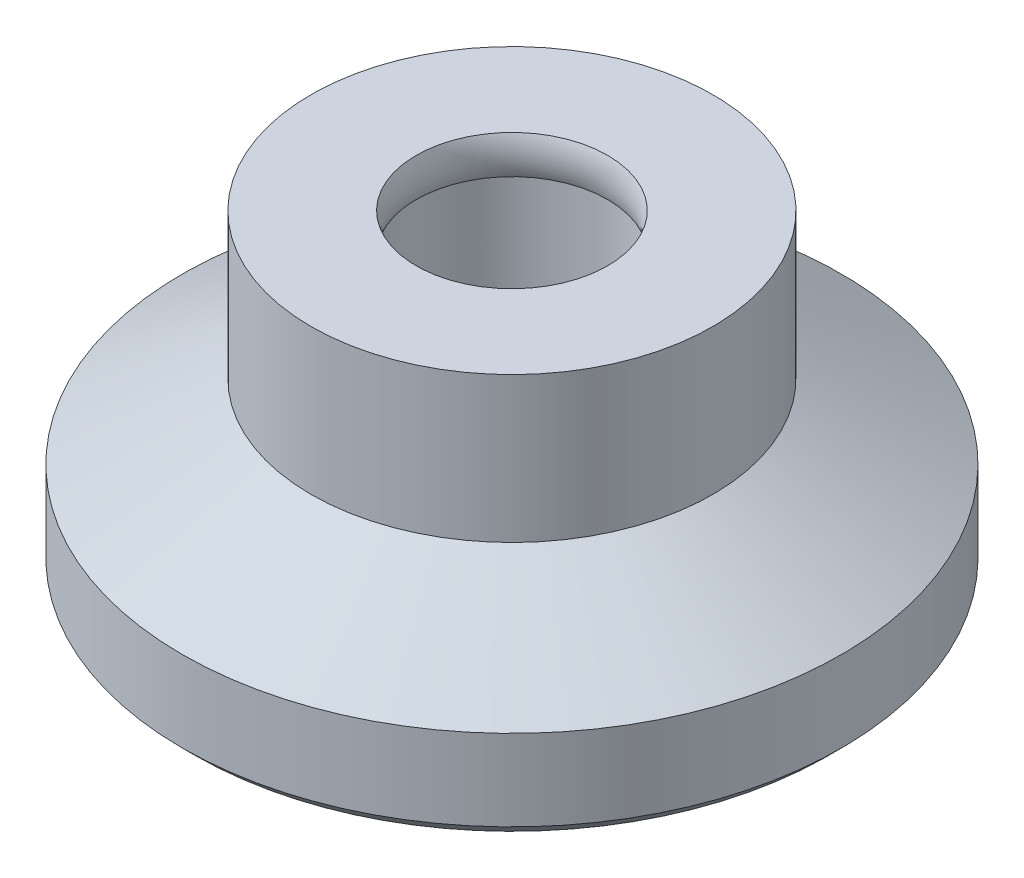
from build123d import *

# Parameters (mm, degrees)
SKETCH1_R      = 6.4
EXTRUDE1_DEPTH = 5
SKETCH3_R      = 10.5
EXTRUDE2_DEPTH = 3
CHAMFER1_SIZE  = 0.42


with BuildPart() as part:
    # Sketch1 → Extrude1 (new, symmetric)
    with BuildSketch(Plane(origin=(0, 0, 0), x_dir=(1, 0, 0), z_dir=(0, 1, 0))):
        with Locations(Location((0, 0, 0), (0, 0, 270))):
            Circle(SKETCH1_R)
    extrude(amount=EXTRUDE1_DEPTH, both=True)

    # Sketch3 → Extrude2 (add)
    with BuildSketch(Plane.XZ.offset(5)):
        with Locations(Location((0, 0, 0), (0, 0, 270))):
            Circle(SKETCH3_R)
    extrude(amount=-EXTRUDE2_DEPTH)

    # Sketch4 → Revolve1 (revolve)
    with BuildSketch(Plane.XY, mode=Mode.PRIVATE) as revolve1_sk:
        Polygon((-10.5, -2), (-6.4, 0.367136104), (-6.4, -2), align=None)
    revolve(revolve1_sk.sketch.rotate(Axis((0, 5, 0), (0, -1, 0)), 270), axis=Axis((0, 5, 0), (0, -1, 0)))

    # Chamfer1
    chamfer1_edges = [part.edges().sort_by_distance(p)[0] for p in [
        (0, -5, 10.5),
    ]]
    chamfer(chamfer1_edges, length=CHAMFER1_SIZE)

    # Sketch5 → Cut-Revolve1 (revolve, cut)
    with BuildSketch(Plane.XY, mode=Mode.PRIVATE) as cut_revolve1_sk:
        with BuildLine():
            Line((0, 5), (3.05, 5))
            ThreePointArc((3.05, 5), (2.928, 4.39), (3.05, 3.78))
            Line((3.05, 3.78), (3.05, -0.239081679))
            Line((3.05, -0.239081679), (0, -2))
            Line((0, -2), (0, 5))
        make_face()
    revolve(cut_revolve1_sk.sketch.rotate(Axis((0, 0, 0), (0, 1, 0)), 270), axis=Axis((0, 0, 0), (0, 1, 0)), mode=Mode.SUBTRACT)


solid = part.part
